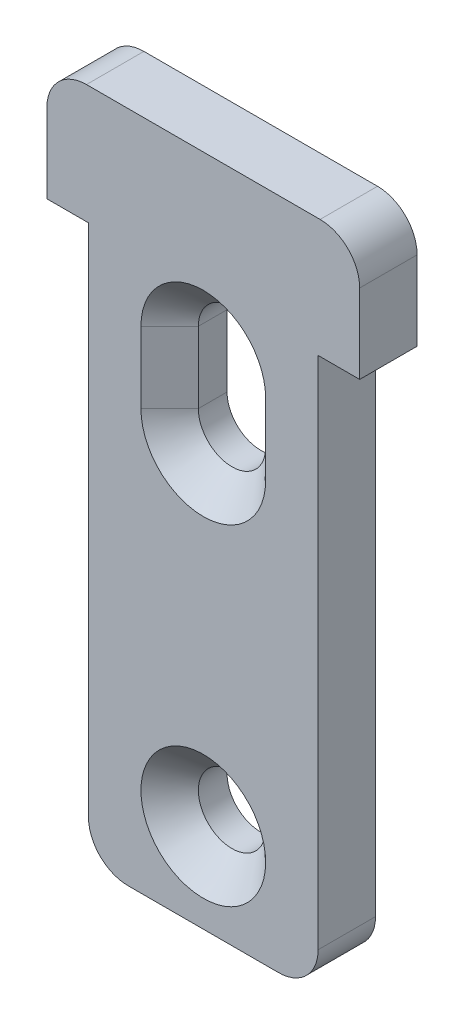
ISO-10303-21;
HEADER;
FILE_DESCRIPTION(('STEP AP214'),'2;1');
FILE_NAME('part.step','',(''),(''),'','','');
FILE_SCHEMA(('AUTOMOTIVE_DESIGN { 1 0 10303 214 1 1 1 1 }'));
ENDSEC;
DATA;
#1=APPLICATION_CONTEXT('core data for automotive mechanical design processes');
#2=APPLICATION_PROTOCOL_DEFINITION('international standard','automotive_design',2000,#1);
#3=PRODUCT_CONTEXT('',#1,'mechanical');
#4=PRODUCT('Part','Part','',(#3));
#5=PRODUCT_RELATED_PRODUCT_CATEGORY('part','',(#4));
#6=PRODUCT_DEFINITION_FORMATION('','',#4);
#7=PRODUCT_DEFINITION_CONTEXT('part definition',#1,'design');
#8=PRODUCT_DEFINITION('design','',#6,#7);
#9=PRODUCT_DEFINITION_SHAPE('','',#8);
#10=(LENGTH_UNIT() NAMED_UNIT(*) SI_UNIT(.MILLI.,.METRE.));
#11=(NAMED_UNIT(*) PLANE_ANGLE_UNIT() SI_UNIT($,.RADIAN.));
#12=(NAMED_UNIT(*) SI_UNIT($,.STERADIAN.) SOLID_ANGLE_UNIT());
#13=UNCERTAINTY_MEASURE_WITH_UNIT(LENGTH_MEASURE(1.E-05),#10,'distance_accuracy_value','');
#14=(GEOMETRIC_REPRESENTATION_CONTEXT(3) GLOBAL_UNCERTAINTY_ASSIGNED_CONTEXT((#13)) GLOBAL_UNIT_ASSIGNED_CONTEXT((#10,
#11,#12)) REPRESENTATION_CONTEXT('',''));
#15=CARTESIAN_POINT('',(0.,0.,0.));
#16=DIRECTION('',(0.,0.,1.));
#17=DIRECTION('',(1.,0.,0.));
#18=AXIS2_PLACEMENT_3D('',#15,#16,#17);
#19=CARTESIAN_POINT('',(5.9,4.,2.9));
#20=DIRECTION('',(0.,0.,-1.));
#21=DIRECTION('',(-1.,0.,0.));
#22=AXIS2_PLACEMENT_3D('',#19,#20,#21);
#23=PLANE('',#22);
#24=CARTESIAN_POINT('',(0.,-23.5,2.9));
#25=DIRECTION('',(0.,0.,1.));
#26=DIRECTION('',(1.,0.,0.));
#27=AXIS2_PLACEMENT_3D('',#24,#25,#26);
#28=CIRCLE('',#27,3.15);
#29=CARTESIAN_POINT('',(3.15,-23.5,2.9));
#30=VERTEX_POINT('',#29);
#31=EDGE_CURVE('E294',#30,#30,#28,.T.);
#32=ORIENTED_EDGE('',*,*,#31,.F.);
#33=EDGE_LOOP('',(#32));
#34=FACE_BOUND('',#33,.T.);
#35=DIRECTION('',(1.,0.,0.));
#36=VECTOR('',#35,1.);
#37=CARTESIAN_POINT('',(5.8,0.,2.9));
#38=LINE('',#37,#36);
#39=CARTESIAN_POINT('',(5.8,0.,2.9));
#40=VERTEX_POINT('',#39);
#41=CARTESIAN_POINT('',(7.9,0.,2.9));
#42=VERTEX_POINT('',#41);
#43=EDGE_CURVE('E303',#40,#42,#38,.T.);
#44=ORIENTED_EDGE('',*,*,#43,.T.);
#45=DIRECTION('',(0.,1.,0.));
#46=VECTOR('',#45,1.);
#47=CARTESIAN_POINT('',(7.9,0.,2.9));
#48=LINE('',#47,#46);
#49=CARTESIAN_POINT('',(7.9,3.99999999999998,2.9));
#50=VERTEX_POINT('',#49);
#51=EDGE_CURVE('E307',#42,#50,#48,.T.);
#52=ORIENTED_EDGE('',*,*,#51,.T.);
#53=CARTESIAN_POINT('',(5.9,4.,2.9));
#54=DIRECTION('',(0.,0.,1.));
#55=DIRECTION('',(-1.,0.,0.));
#56=AXIS2_PLACEMENT_3D('',#53,#54,#55);
#57=CIRCLE('',#56,2.);
#58=CARTESIAN_POINT('',(5.89999999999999,6.,2.9));
#59=VERTEX_POINT('',#58);
#60=EDGE_CURVE('E311',#50,#59,#57,.T.);
#61=ORIENTED_EDGE('',*,*,#60,.T.);
#62=DIRECTION('',(-1.,0.,0.));
#63=VECTOR('',#62,1.);
#64=CARTESIAN_POINT('',(-5.89999999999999,6.,2.9));
#65=LINE('',#64,#63);
#66=CARTESIAN_POINT('',(-5.89999999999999,6.,2.9));
#67=VERTEX_POINT('',#66);
#68=EDGE_CURVE('E314',#59,#67,#65,.T.);
#69=ORIENTED_EDGE('',*,*,#68,.T.);
#70=CARTESIAN_POINT('',(-5.9,4.,2.9));
#71=DIRECTION('',(0.,0.,1.));
#72=DIRECTION('',(-1.,0.,0.));
#73=AXIS2_PLACEMENT_3D('',#70,#71,#72);
#74=CIRCLE('',#73,2.);
#75=CARTESIAN_POINT('',(-7.9,3.99999999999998,2.9));
#76=VERTEX_POINT('',#75);
#77=EDGE_CURVE('E317',#67,#76,#74,.T.);
#78=ORIENTED_EDGE('',*,*,#77,.T.);
#79=DIRECTION('',(0.,-1.,0.));
#80=VECTOR('',#79,1.);
#81=CARTESIAN_POINT('',(-7.9,0.,2.9));
#82=LINE('',#81,#80);
#83=CARTESIAN_POINT('',(-7.9,0.,2.9));
#84=VERTEX_POINT('',#83);
#85=EDGE_CURVE('E320',#76,#84,#82,.T.);
#86=ORIENTED_EDGE('',*,*,#85,.T.);
#87=DIRECTION('',(1.,0.,0.));
#88=VECTOR('',#87,1.);
#89=CARTESIAN_POINT('',(-7.9,0.,2.9));
#90=LINE('',#89,#88);
#91=CARTESIAN_POINT('',(-5.8,0.,2.9));
#92=VERTEX_POINT('',#91);
#93=EDGE_CURVE('E323',#84,#92,#90,.T.);
#94=ORIENTED_EDGE('',*,*,#93,.T.);
#95=DIRECTION('',(0.,-1.,0.));
#96=VECTOR('',#95,1.);
#97=CARTESIAN_POINT('',(-5.8,0.,2.9));
#98=LINE('',#97,#96);
#99=CARTESIAN_POINT('',(-5.8,-26.,2.9));
#100=VERTEX_POINT('',#99);
#101=EDGE_CURVE('E326',#92,#100,#98,.T.);
#102=ORIENTED_EDGE('',*,*,#101,.T.);
#103=CARTESIAN_POINT('',(-3.8,-26.,2.9));
#104=DIRECTION('',(0.,0.,1.));
#105=DIRECTION('',(1.,0.,0.));
#106=AXIS2_PLACEMENT_3D('',#103,#104,#105);
#107=CIRCLE('',#106,2.);
#108=CARTESIAN_POINT('',(-3.79999999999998,-28.,2.9));
#109=VERTEX_POINT('',#108);
#110=EDGE_CURVE('E329',#100,#109,#107,.T.);
#111=ORIENTED_EDGE('',*,*,#110,.T.);
#112=DIRECTION('',(1.,0.,0.));
#113=VECTOR('',#112,1.);
#114=CARTESIAN_POINT('',(-3.79999999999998,-28.,2.9));
#115=LINE('',#114,#113);
#116=CARTESIAN_POINT('',(3.79999999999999,-28.,2.9));
#117=VERTEX_POINT('',#116);
#118=EDGE_CURVE('E332',#109,#117,#115,.T.);
#119=ORIENTED_EDGE('',*,*,#118,.T.);
#120=CARTESIAN_POINT('',(3.8,-26.,2.9));
#121=DIRECTION('',(0.,0.,1.));
#122=DIRECTION('',(1.,0.,0.));
#123=AXIS2_PLACEMENT_3D('',#120,#121,#122);
#124=CIRCLE('',#123,2.);
#125=CARTESIAN_POINT('',(5.8,-26.,2.9));
#126=VERTEX_POINT('',#125);
#127=EDGE_CURVE('E335',#117,#126,#124,.T.);
#128=ORIENTED_EDGE('',*,*,#127,.T.);
#129=DIRECTION('',(0.,1.,0.));
#130=VECTOR('',#129,1.);
#131=CARTESIAN_POINT('',(5.8,-26.,2.9));
#132=LINE('',#131,#130);
#133=EDGE_CURVE('E338',#126,#40,#132,.T.);
#134=ORIENTED_EDGE('',*,*,#133,.T.);
#135=EDGE_LOOP('',(#44,#52,#61,#69,#78,#86,#94,#102,#111,#119,#128,#134));
#136=FACE_BOUND('',#135,.T.);
#137=DIRECTION('',(0.,-1.,0.));
#138=VECTOR('',#137,1.);
#139=CARTESIAN_POINT('',(-3.14999999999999,-3.2,2.9));
#140=LINE('',#139,#138);
#141=CARTESIAN_POINT('',(-3.15,-3.2,2.9));
#142=VERTEX_POINT('',#141);
#143=CARTESIAN_POINT('',(-3.14999999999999,-6.8,2.9));
#144=VERTEX_POINT('',#143);
#145=EDGE_CURVE('E263',#142,#144,#140,.T.);
#146=ORIENTED_EDGE('',*,*,#145,.F.);
#147=CARTESIAN_POINT('',(0.,-3.2,2.9));
#148=DIRECTION('',(0.,0.,1.));
#149=DIRECTION('',(1.,0.,0.));
#150=AXIS2_PLACEMENT_3D('',#147,#148,#149);
#151=CIRCLE('',#150,3.15);
#152=CARTESIAN_POINT('',(3.15,-3.2,2.9));
#153=VERTEX_POINT('',#152);
#154=EDGE_CURVE('E256',#153,#142,#151,.T.);
#155=ORIENTED_EDGE('',*,*,#154,.F.);
#156=DIRECTION('',(0.,-1.,0.));
#157=VECTOR('',#156,1.);
#158=CARTESIAN_POINT('',(3.15,-3.2,2.9));
#159=LINE('',#158,#157);
#160=CARTESIAN_POINT('',(3.15,-6.8,2.9));
#161=VERTEX_POINT('',#160);
#162=EDGE_CURVE('E240',#153,#161,#159,.T.);
#163=ORIENTED_EDGE('',*,*,#162,.T.);
#164=CARTESIAN_POINT('',(0.,-6.8,2.9));
#165=DIRECTION('',(0.,0.,1.));
#166=DIRECTION('',(1.,0.,0.));
#167=AXIS2_PLACEMENT_3D('',#164,#165,#166);
#168=CIRCLE('',#167,3.15);
#169=EDGE_CURVE('E283',#144,#161,#168,.T.);
#170=ORIENTED_EDGE('',*,*,#169,.F.);
#171=EDGE_LOOP('',(#146,#155,#163,#170));
#172=FACE_BOUND('',#171,.T.);
#173=ADVANCED_FACE('F115',(#34,#136,#172),#23,.F.);
#174=CARTESIAN_POINT('',(5.9,4.,0.));
#175=DIRECTION('',(0.,0.,-1.));
#176=DIRECTION('',(-1.,0.,0.));
#177=AXIS2_PLACEMENT_3D('',#174,#175,#176);
#178=PLANE('',#177);
#179=CARTESIAN_POINT('',(0.,-23.5,0.));
#180=DIRECTION('',(0.,0.,-1.));
#181=DIRECTION('',(-1.,0.,0.));
#182=AXIS2_PLACEMENT_3D('',#179,#180,#181);
#183=CIRCLE('',#182,1.69999999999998);
#184=CARTESIAN_POINT('',(-1.69999999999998,-23.5,0.));
#185=VERTEX_POINT('',#184);
#186=EDGE_CURVE('E302',#185,#185,#183,.T.);
#187=ORIENTED_EDGE('',*,*,#186,.F.);
#188=EDGE_LOOP('',(#187));
#189=FACE_BOUND('',#188,.T.);
#190=DIRECTION('',(1.,0.,0.));
#191=VECTOR('',#190,1.);
#192=CARTESIAN_POINT('',(5.8,0.,0.));
#193=LINE('',#192,#191);
#194=CARTESIAN_POINT('',(5.8,0.,0.));
#195=VERTEX_POINT('',#194);
#196=CARTESIAN_POINT('',(7.9,0.,0.));
#197=VERTEX_POINT('',#196);
#198=EDGE_CURVE('E342',#195,#197,#193,.T.);
#199=ORIENTED_EDGE('',*,*,#198,.F.);
#200=DIRECTION('',(0.,1.,0.));
#201=VECTOR('',#200,1.);
#202=CARTESIAN_POINT('',(5.8,-26.,0.));
#203=LINE('',#202,#201);
#204=CARTESIAN_POINT('',(5.8,-26.,0.));
#205=VERTEX_POINT('',#204);
#206=EDGE_CURVE('E308',#205,#195,#203,.T.);
#207=ORIENTED_EDGE('',*,*,#206,.F.);
#208=CARTESIAN_POINT('',(3.8,-26.,0.));
#209=DIRECTION('',(0.,0.,1.));
#210=DIRECTION('',(1.,0.,0.));
#211=AXIS2_PLACEMENT_3D('',#208,#209,#210);
#212=CIRCLE('',#211,2.);
#213=CARTESIAN_POINT('',(3.79999999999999,-28.,0.));
#214=VERTEX_POINT('',#213);
#215=EDGE_CURVE('E373',#214,#205,#212,.T.);
#216=ORIENTED_EDGE('',*,*,#215,.F.);
#217=DIRECTION('',(1.,0.,0.));
#218=VECTOR('',#217,1.);
#219=CARTESIAN_POINT('',(-3.79999999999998,-28.,0.));
#220=LINE('',#219,#218);
#221=CARTESIAN_POINT('',(-3.79999999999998,-28.,0.));
#222=VERTEX_POINT('',#221);
#223=EDGE_CURVE('E370',#222,#214,#220,.T.);
#224=ORIENTED_EDGE('',*,*,#223,.F.);
#225=CARTESIAN_POINT('',(-3.8,-26.,0.));
#226=DIRECTION('',(0.,0.,1.));
#227=DIRECTION('',(1.,0.,0.));
#228=AXIS2_PLACEMENT_3D('',#225,#226,#227);
#229=CIRCLE('',#228,2.);
#230=CARTESIAN_POINT('',(-5.8,-26.,0.));
#231=VERTEX_POINT('',#230);
#232=EDGE_CURVE('E367',#231,#222,#229,.T.);
#233=ORIENTED_EDGE('',*,*,#232,.F.);
#234=DIRECTION('',(0.,-1.,0.));
#235=VECTOR('',#234,1.);
#236=CARTESIAN_POINT('',(-5.8,0.,0.));
#237=LINE('',#236,#235);
#238=CARTESIAN_POINT('',(-5.8,0.,0.));
#239=VERTEX_POINT('',#238);
#240=EDGE_CURVE('E364',#239,#231,#237,.T.);
#241=ORIENTED_EDGE('',*,*,#240,.F.);
#242=DIRECTION('',(1.,0.,0.));
#243=VECTOR('',#242,1.);
#244=CARTESIAN_POINT('',(-7.9,0.,0.));
#245=LINE('',#244,#243);
#246=CARTESIAN_POINT('',(-7.9,0.,0.));
#247=VERTEX_POINT('',#246);
#248=EDGE_CURVE('E361',#247,#239,#245,.T.);
#249=ORIENTED_EDGE('',*,*,#248,.F.);
#250=DIRECTION('',(0.,-1.,0.));
#251=VECTOR('',#250,1.);
#252=CARTESIAN_POINT('',(-7.9,0.,0.));
#253=LINE('',#252,#251);
#254=CARTESIAN_POINT('',(-7.9,3.99999999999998,0.));
#255=VERTEX_POINT('',#254);
#256=EDGE_CURVE('E358',#255,#247,#253,.T.);
#257=ORIENTED_EDGE('',*,*,#256,.F.);
#258=CARTESIAN_POINT('',(-5.9,4.,0.));
#259=DIRECTION('',(0.,0.,1.));
#260=DIRECTION('',(-1.,0.,0.));
#261=AXIS2_PLACEMENT_3D('',#258,#259,#260);
#262=CIRCLE('',#261,2.);
#263=CARTESIAN_POINT('',(-5.89999999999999,6.,0.));
#264=VERTEX_POINT('',#263);
#265=EDGE_CURVE('E355',#264,#255,#262,.T.);
#266=ORIENTED_EDGE('',*,*,#265,.F.);
#267=DIRECTION('',(-1.,0.,0.));
#268=VECTOR('',#267,1.);
#269=CARTESIAN_POINT('',(-5.89999999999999,6.,0.));
#270=LINE('',#269,#268);
#271=CARTESIAN_POINT('',(5.89999999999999,6.,0.));
#272=VERTEX_POINT('',#271);
#273=EDGE_CURVE('E352',#272,#264,#270,.T.);
#274=ORIENTED_EDGE('',*,*,#273,.F.);
#275=CARTESIAN_POINT('',(5.9,4.,0.));
#276=DIRECTION('',(0.,0.,1.));
#277=DIRECTION('',(-1.,0.,0.));
#278=AXIS2_PLACEMENT_3D('',#275,#276,#277);
#279=CIRCLE('',#278,2.);
#280=CARTESIAN_POINT('',(7.9,3.99999999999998,0.));
#281=VERTEX_POINT('',#280);
#282=EDGE_CURVE('E349',#281,#272,#279,.T.);
#283=ORIENTED_EDGE('',*,*,#282,.F.);
#284=DIRECTION('',(0.,1.,0.));
#285=VECTOR('',#284,1.);
#286=CARTESIAN_POINT('',(7.9,0.,0.));
#287=LINE('',#286,#285);
#288=EDGE_CURVE('E346',#197,#281,#287,.T.);
#289=ORIENTED_EDGE('',*,*,#288,.F.);
#290=EDGE_LOOP('',(#199,#207,#216,#224,#233,#241,#249,#257,#266,#274,#283,#289));
#291=FACE_BOUND('',#290,.T.);
#292=CARTESIAN_POINT('',(0.,-6.8,0.));
#293=DIRECTION('',(0.,0.,-1.));
#294=DIRECTION('',(-1.,0.,0.));
#295=AXIS2_PLACEMENT_3D('',#292,#293,#294);
#296=CIRCLE('',#295,1.69999999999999);
#297=CARTESIAN_POINT('',(1.69999999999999,-6.8,0.));
#298=VERTEX_POINT('',#297);
#299=CARTESIAN_POINT('',(-1.69999999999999,-6.8,0.));
#300=VERTEX_POINT('',#299);
#301=EDGE_CURVE('E431',#298,#300,#296,.T.);
#302=ORIENTED_EDGE('',*,*,#301,.F.);
#303=DIRECTION('',(0.,1.,0.));
#304=VECTOR('',#303,1.);
#305=CARTESIAN_POINT('',(1.69999999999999,4.,0.));
#306=LINE('',#305,#304);
#307=CARTESIAN_POINT('',(1.69999999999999,-3.2,0.));
#308=VERTEX_POINT('',#307);
#309=EDGE_CURVE('E13',#298,#308,#306,.T.);
#310=ORIENTED_EDGE('',*,*,#309,.T.);
#311=CARTESIAN_POINT('',(0.,-3.2,0.));
#312=DIRECTION('',(0.,0.,-1.));
#313=DIRECTION('',(-1.,0.,0.));
#314=AXIS2_PLACEMENT_3D('',#311,#312,#313);
#315=CIRCLE('',#314,1.69999999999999);
#316=CARTESIAN_POINT('',(-1.69999999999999,-3.2,0.));
#317=VERTEX_POINT('',#316);
#318=EDGE_CURVE('E124',#317,#308,#315,.T.);
#319=ORIENTED_EDGE('',*,*,#318,.F.);
#320=DIRECTION('',(0.,1.,0.));
#321=VECTOR('',#320,1.);
#322=CARTESIAN_POINT('',(-1.69999999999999,4.,0.));
#323=LINE('',#322,#321);
#324=EDGE_CURVE('E425',#300,#317,#323,.T.);
#325=ORIENTED_EDGE('',*,*,#324,.F.);
#326=EDGE_LOOP('',(#302,#310,#319,#325));
#327=FACE_BOUND('',#326,.T.);
#328=ADVANCED_FACE('F445',(#189,#291,#327),#178,.T.);
#329=CARTESIAN_POINT('',(5.8,0.,2.9));
#330=DIRECTION('',(0.,1.,0.));
#331=DIRECTION('',(-1.,0.,0.));
#332=AXIS2_PLACEMENT_3D('',#329,#330,#331);
#333=PLANE('',#332);
#334=ORIENTED_EDGE('',*,*,#198,.T.);
#335=DIRECTION('',(0.,0.,-1.));
#336=VECTOR('',#335,1.);
#337=CARTESIAN_POINT('',(7.9,0.,2.9));
#338=LINE('',#337,#336);
#339=EDGE_CURVE('E421',#42,#197,#338,.T.);
#340=ORIENTED_EDGE('',*,*,#339,.F.);
#341=ORIENTED_EDGE('',*,*,#43,.F.);
#342=DIRECTION('',(0.,0.,-1.));
#343=VECTOR('',#342,1.);
#344=CARTESIAN_POINT('',(5.8,0.,2.9));
#345=LINE('',#344,#343);
#346=EDGE_CURVE('E341',#40,#195,#345,.T.);
#347=ORIENTED_EDGE('',*,*,#346,.T.);
#348=EDGE_LOOP('',(#334,#340,#341,#347));
#349=FACE_BOUND('',#348,.T.);
#350=ADVANCED_FACE('F117',(#349),#333,.F.);
#351=CARTESIAN_POINT('',(7.9,0.,2.9));
#352=DIRECTION('',(-1.,0.,0.));
#353=DIRECTION('',(0.,0.,1.));
#354=AXIS2_PLACEMENT_3D('',#351,#352,#353);
#355=PLANE('',#354);
#356=ORIENTED_EDGE('',*,*,#288,.T.);
#357=DIRECTION('',(0.,0.,-1.));
#358=VECTOR('',#357,1.);
#359=CARTESIAN_POINT('',(7.9,3.99999999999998,2.9));
#360=LINE('',#359,#358);
#361=EDGE_CURVE('E417',#50,#281,#360,.T.);
#362=ORIENTED_EDGE('',*,*,#361,.F.);
#363=ORIENTED_EDGE('',*,*,#51,.F.);
#364=ORIENTED_EDGE('',*,*,#339,.T.);
#365=EDGE_LOOP('',(#356,#362,#363,#364));
#366=FACE_BOUND('',#365,.T.);
#367=ADVANCED_FACE('F523',(#366),#355,.F.);
#368=CARTESIAN_POINT('',(5.9,4.,2.9));
#369=DIRECTION('',(0.,0.,-1.));
#370=DIRECTION('',(-1.,0.,0.));
#371=AXIS2_PLACEMENT_3D('',#368,#369,#370);
#372=CYLINDRICAL_SURFACE('',#371,2.);
#373=ORIENTED_EDGE('',*,*,#282,.T.);
#374=DIRECTION('',(0.,0.,-1.));
#375=VECTOR('',#374,1.);
#376=CARTESIAN_POINT('',(5.89999999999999,6.,2.9));
#377=LINE('',#376,#375);
#378=EDGE_CURVE('E413',#59,#272,#377,.T.);
#379=ORIENTED_EDGE('',*,*,#378,.F.);
#380=ORIENTED_EDGE('',*,*,#60,.F.);
#381=ORIENTED_EDGE('',*,*,#361,.T.);
#382=EDGE_LOOP('',(#373,#379,#380,#381));
#383=FACE_BOUND('',#382,.T.);
#384=ADVANCED_FACE('F520',(#383),#372,.T.);
#385=CARTESIAN_POINT('',(-5.89999999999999,6.,2.9));
#386=DIRECTION('',(0.,-1.,0.));
#387=DIRECTION('',(0.,0.,-1.));
#388=AXIS2_PLACEMENT_3D('',#385,#386,#387);
#389=PLANE('',#388);
#390=ORIENTED_EDGE('',*,*,#273,.T.);
#391=DIRECTION('',(0.,0.,-1.));
#392=VECTOR('',#391,1.);
#393=CARTESIAN_POINT('',(-5.89999999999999,6.,2.9));
#394=LINE('',#393,#392);
#395=EDGE_CURVE('E409',#67,#264,#394,.T.);
#396=ORIENTED_EDGE('',*,*,#395,.F.);
#397=ORIENTED_EDGE('',*,*,#68,.F.);
#398=ORIENTED_EDGE('',*,*,#378,.T.);
#399=EDGE_LOOP('',(#390,#396,#397,#398));
#400=FACE_BOUND('',#399,.T.);
#401=ADVANCED_FACE('F516',(#400),#389,.F.);
#402=CARTESIAN_POINT('',(-5.9,4.,2.9));
#403=DIRECTION('',(0.,0.,-1.));
#404=DIRECTION('',(-1.,0.,0.));
#405=AXIS2_PLACEMENT_3D('',#402,#403,#404);
#406=CYLINDRICAL_SURFACE('',#405,2.);
#407=ORIENTED_EDGE('',*,*,#265,.T.);
#408=DIRECTION('',(0.,0.,-1.));
#409=VECTOR('',#408,1.);
#410=CARTESIAN_POINT('',(-7.9,3.99999999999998,2.9));
#411=LINE('',#410,#409);
#412=EDGE_CURVE('E405',#76,#255,#411,.T.);
#413=ORIENTED_EDGE('',*,*,#412,.F.);
#414=ORIENTED_EDGE('',*,*,#77,.F.);
#415=ORIENTED_EDGE('',*,*,#395,.T.);
#416=EDGE_LOOP('',(#407,#413,#414,#415));
#417=FACE_BOUND('',#416,.T.);
#418=ADVANCED_FACE('F512',(#417),#406,.T.);
#419=CARTESIAN_POINT('',(-7.9,0.,2.9));
#420=DIRECTION('',(1.,0.,0.));
#421=DIRECTION('',(0.,0.,-1.));
#422=AXIS2_PLACEMENT_3D('',#419,#420,#421);
#423=PLANE('',#422);
#424=ORIENTED_EDGE('',*,*,#256,.T.);
#425=DIRECTION('',(0.,0.,-1.));
#426=VECTOR('',#425,1.);
#427=CARTESIAN_POINT('',(-7.9,0.,2.9));
#428=LINE('',#427,#426);
#429=EDGE_CURVE('E401',#84,#247,#428,.T.);
#430=ORIENTED_EDGE('',*,*,#429,.F.);
#431=ORIENTED_EDGE('',*,*,#85,.F.);
#432=ORIENTED_EDGE('',*,*,#412,.T.);
#433=EDGE_LOOP('',(#424,#430,#431,#432));
#434=FACE_BOUND('',#433,.T.);
#435=ADVANCED_FACE('F508',(#434),#423,.F.);
#436=CARTESIAN_POINT('',(-7.9,0.,2.9));
#437=DIRECTION('',(0.,1.,0.));
#438=DIRECTION('',(-1.,0.,0.));
#439=AXIS2_PLACEMENT_3D('',#436,#437,#438);
#440=PLANE('',#439);
#441=ORIENTED_EDGE('',*,*,#248,.T.);
#442=DIRECTION('',(0.,0.,-1.));
#443=VECTOR('',#442,1.);
#444=CARTESIAN_POINT('',(-5.8,0.,2.9));
#445=LINE('',#444,#443);
#446=EDGE_CURVE('E397',#92,#239,#445,.T.);
#447=ORIENTED_EDGE('',*,*,#446,.F.);
#448=ORIENTED_EDGE('',*,*,#93,.F.);
#449=ORIENTED_EDGE('',*,*,#429,.T.);
#450=EDGE_LOOP('',(#441,#447,#448,#449));
#451=FACE_BOUND('',#450,.T.);
#452=ADVANCED_FACE('F504',(#451),#440,.F.);
#453=CARTESIAN_POINT('',(-5.8,0.,2.9));
#454=DIRECTION('',(1.,0.,0.));
#455=DIRECTION('',(0.,1.,0.));
#456=AXIS2_PLACEMENT_3D('',#453,#454,#455);
#457=PLANE('',#456);
#458=ORIENTED_EDGE('',*,*,#240,.T.);
#459=DIRECTION('',(0.,0.,-1.));
#460=VECTOR('',#459,1.);
#461=CARTESIAN_POINT('',(-5.8,-26.,2.9));
#462=LINE('',#461,#460);
#463=EDGE_CURVE('E393',#100,#231,#462,.T.);
#464=ORIENTED_EDGE('',*,*,#463,.F.);
#465=ORIENTED_EDGE('',*,*,#101,.F.);
#466=ORIENTED_EDGE('',*,*,#446,.T.);
#467=EDGE_LOOP('',(#458,#464,#465,#466));
#468=FACE_BOUND('',#467,.T.);
#469=ADVANCED_FACE('F500',(#468),#457,.F.);
#470=CARTESIAN_POINT('',(-3.8,-26.,2.9));
#471=DIRECTION('',(0.,0.,-1.));
#472=DIRECTION('',(-1.,0.,0.));
#473=AXIS2_PLACEMENT_3D('',#470,#471,#472);
#474=CYLINDRICAL_SURFACE('',#473,2.);
#475=ORIENTED_EDGE('',*,*,#232,.T.);
#476=DIRECTION('',(0.,0.,-1.));
#477=VECTOR('',#476,1.);
#478=CARTESIAN_POINT('',(-3.79999999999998,-28.,2.9));
#479=LINE('',#478,#477);
#480=EDGE_CURVE('E389',#109,#222,#479,.T.);
#481=ORIENTED_EDGE('',*,*,#480,.F.);
#482=ORIENTED_EDGE('',*,*,#110,.F.);
#483=ORIENTED_EDGE('',*,*,#463,.T.);
#484=EDGE_LOOP('',(#475,#481,#482,#483));
#485=FACE_BOUND('',#484,.T.);
#486=ADVANCED_FACE('F496',(#485),#474,.T.);
#487=CARTESIAN_POINT('',(-3.79999999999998,-28.,2.9));
#488=DIRECTION('',(0.,1.,0.));
#489=DIRECTION('',(0.,0.,1.));
#490=AXIS2_PLACEMENT_3D('',#487,#488,#489);
#491=PLANE('',#490);
#492=ORIENTED_EDGE('',*,*,#223,.T.);
#493=DIRECTION('',(0.,0.,-1.));
#494=VECTOR('',#493,1.);
#495=CARTESIAN_POINT('',(3.79999999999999,-28.,2.9));
#496=LINE('',#495,#494);
#497=EDGE_CURVE('E385',#117,#214,#496,.T.);
#498=ORIENTED_EDGE('',*,*,#497,.F.);
#499=ORIENTED_EDGE('',*,*,#118,.F.);
#500=ORIENTED_EDGE('',*,*,#480,.T.);
#501=EDGE_LOOP('',(#492,#498,#499,#500));
#502=FACE_BOUND('',#501,.T.);
#503=ADVANCED_FACE('F492',(#502),#491,.F.);
#504=CARTESIAN_POINT('',(3.8,-26.,2.9));
#505=DIRECTION('',(0.,0.,-1.));
#506=DIRECTION('',(-1.,0.,0.));
#507=AXIS2_PLACEMENT_3D('',#504,#505,#506);
#508=CYLINDRICAL_SURFACE('',#507,2.);
#509=ORIENTED_EDGE('',*,*,#215,.T.);
#510=DIRECTION('',(0.,0.,-1.));
#511=VECTOR('',#510,1.);
#512=CARTESIAN_POINT('',(5.8,-26.,2.9));
#513=LINE('',#512,#511);
#514=EDGE_CURVE('E381',#126,#205,#513,.T.);
#515=ORIENTED_EDGE('',*,*,#514,.F.);
#516=ORIENTED_EDGE('',*,*,#127,.F.);
#517=ORIENTED_EDGE('',*,*,#497,.T.);
#518=EDGE_LOOP('',(#509,#515,#516,#517));
#519=FACE_BOUND('',#518,.T.);
#520=ADVANCED_FACE('F488',(#519),#508,.T.);
#521=CARTESIAN_POINT('',(5.8,-26.,2.9));
#522=DIRECTION('',(-1.,0.,0.));
#523=DIRECTION('',(0.,0.,1.));
#524=AXIS2_PLACEMENT_3D('',#521,#522,#523);
#525=PLANE('',#524);
#526=ORIENTED_EDGE('',*,*,#206,.T.);
#527=ORIENTED_EDGE('',*,*,#346,.F.);
#528=ORIENTED_EDGE('',*,*,#133,.F.);
#529=ORIENTED_EDGE('',*,*,#514,.T.);
#530=EDGE_LOOP('',(#526,#527,#528,#529));
#531=FACE_BOUND('',#530,.T.);
#532=ADVANCED_FACE('F485',(#531),#525,.F.);
#533=CARTESIAN_POINT('',(0.,-23.5,2.9));
#534=DIRECTION('',(0.,0.,1.));
#535=DIRECTION('',(1.,0.,0.));
#536=AXIS2_PLACEMENT_3D('',#533,#534,#535);
#537=CYLINDRICAL_SURFACE('',#536,1.69999999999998);
#538=ORIENTED_EDGE('',*,*,#186,.T.);
#539=EDGE_LOOP('',(#538));
#540=FACE_BOUND('',#539,.T.);
#541=CARTESIAN_POINT('',(0.,-23.5,1.44999999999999));
#542=DIRECTION('',(0.,0.,1.));
#543=DIRECTION('',(1.,0.,0.));
#544=AXIS2_PLACEMENT_3D('',#541,#542,#543);
#545=CIRCLE('',#544,1.69999999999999);
#546=CARTESIAN_POINT('',(1.69999999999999,-23.5,1.44999999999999));
#547=VERTEX_POINT('',#546);
#548=EDGE_CURVE('E298',#547,#547,#545,.T.);
#549=ORIENTED_EDGE('',*,*,#548,.T.);
#550=EDGE_LOOP('',(#549));
#551=FACE_BOUND('',#550,.T.);
#552=ADVANCED_FACE('F482',(#540,#551),#537,.F.);
#553=CARTESIAN_POINT('',(0.,-23.5,2.9));
#554=DIRECTION('',(0.,0.,1.));
#555=DIRECTION('',(1.,0.,0.));
#556=AXIS2_PLACEMENT_3D('',#553,#554,#555);
#557=CONICAL_SURFACE('',#556,3.15,0.78539816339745);
#558=ORIENTED_EDGE('',*,*,#548,.F.);
#559=EDGE_LOOP('',(#558));
#560=FACE_BOUND('',#559,.T.);
#561=ORIENTED_EDGE('',*,*,#31,.T.);
#562=EDGE_LOOP('',(#561));
#563=FACE_BOUND('',#562,.T.);
#564=ADVANCED_FACE('F592',(#560,#563),#557,.F.);
#565=CARTESIAN_POINT('',(0.,-6.8,2.9));
#566=DIRECTION('',(0.,0.,1.));
#567=DIRECTION('',(1.,0.,0.));
#568=AXIS2_PLACEMENT_3D('',#565,#566,#567);
#569=CYLINDRICAL_SURFACE('',#568,1.69999999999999);
#570=ORIENTED_EDGE('',*,*,#301,.T.);
#571=DIRECTION('',(0.,0.,1.));
#572=VECTOR('',#571,1.);
#573=CARTESIAN_POINT('',(-1.69999999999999,-6.8,2.9));
#574=LINE('',#573,#572);
#575=CARTESIAN_POINT('',(-1.69999999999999,-6.8,1.44999999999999));
#576=VERTEX_POINT('',#575);
#577=EDGE_CURVE('E139',#576,#300,#574,.F.);
#578=ORIENTED_EDGE('',*,*,#577,.F.);
#579=CARTESIAN_POINT('',(0.,-6.8,1.44999999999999));
#580=DIRECTION('',(0.,0.,1.));
#581=DIRECTION('',(1.,0.,0.));
#582=AXIS2_PLACEMENT_3D('',#579,#580,#581);
#583=CIRCLE('',#582,1.69999999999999);
#584=CARTESIAN_POINT('',(1.69999999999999,-6.8,1.44999999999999));
#585=VERTEX_POINT('',#584);
#586=EDGE_CURVE('E286',#576,#585,#583,.T.);
#587=ORIENTED_EDGE('',*,*,#586,.T.);
#588=DIRECTION('',(0.,0.,-1.));
#589=VECTOR('',#588,1.);
#590=CARTESIAN_POINT('',(1.7,-6.8,-2.1));
#591=LINE('',#590,#589);
#592=EDGE_CURVE('E279',#585,#298,#591,.T.);
#593=ORIENTED_EDGE('',*,*,#592,.T.);
#594=EDGE_LOOP('',(#570,#578,#587,#593));
#595=FACE_BOUND('',#594,.T.);
#596=ADVANCED_FACE('F447',(#595),#569,.F.);
#597=CARTESIAN_POINT('',(0.,-6.8,2.9));
#598=DIRECTION('',(0.,0.,1.));
#599=DIRECTION('',(1.,0.,0.));
#600=AXIS2_PLACEMENT_3D('',#597,#598,#599);
#601=CONICAL_SURFACE('',#600,3.15,0.78539816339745);
#602=ORIENTED_EDGE('',*,*,#169,.T.);
#603=DIRECTION('',(-0.707106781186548,0.,-0.707106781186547));
#604=VECTOR('',#603,1.);
#605=CARTESIAN_POINT('',(1.69999999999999,-6.8,1.44999999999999));
#606=LINE('',#605,#604);
#607=EDGE_CURVE('E131',#161,#585,#606,.T.);
#608=ORIENTED_EDGE('',*,*,#607,.T.);
#609=ORIENTED_EDGE('',*,*,#586,.F.);
#610=DIRECTION('',(-0.707106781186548,0.,0.707106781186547));
#611=VECTOR('',#610,1.);
#612=CARTESIAN_POINT('',(0.,-6.8,-0.249999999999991));
#613=LINE('',#612,#611);
#614=EDGE_CURVE('E290',#144,#576,#613,.F.);
#615=ORIENTED_EDGE('',*,*,#614,.F.);
#616=EDGE_LOOP('',(#602,#608,#609,#615));
#617=FACE_BOUND('',#616,.T.);
#618=ADVANCED_FACE('F451',(#617),#601,.F.);
#619=CARTESIAN_POINT('',(0.,-3.2,2.9));
#620=DIRECTION('',(0.,0.,1.));
#621=DIRECTION('',(1.,0.,0.));
#622=AXIS2_PLACEMENT_3D('',#619,#620,#621);
#623=CYLINDRICAL_SURFACE('',#622,1.69999999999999);
#624=ORIENTED_EDGE('',*,*,#318,.T.);
#625=DIRECTION('',(0.,0.,-1.));
#626=VECTOR('',#625,1.);
#627=CARTESIAN_POINT('',(1.7,-3.2,-2.1));
#628=LINE('',#627,#626);
#629=CARTESIAN_POINT('',(1.69999999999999,-3.2,1.44999999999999));
#630=VERTEX_POINT('',#629);
#631=EDGE_CURVE('E261',#630,#308,#628,.T.);
#632=ORIENTED_EDGE('',*,*,#631,.F.);
#633=CARTESIAN_POINT('',(0.,-3.2,1.44999999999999));
#634=DIRECTION('',(0.,0.,1.));
#635=DIRECTION('',(1.,0.,0.));
#636=AXIS2_PLACEMENT_3D('',#633,#634,#635);
#637=CIRCLE('',#636,1.69999999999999);
#638=CARTESIAN_POINT('',(-1.69999999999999,-3.2,1.44999999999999));
#639=VERTEX_POINT('',#638);
#640=EDGE_CURVE('E259',#630,#639,#637,.T.);
#641=ORIENTED_EDGE('',*,*,#640,.T.);
#642=DIRECTION('',(0.,0.,1.));
#643=VECTOR('',#642,1.);
#644=CARTESIAN_POINT('',(-1.69999999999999,-3.2,2.9));
#645=LINE('',#644,#643);
#646=EDGE_CURVE('E248',#317,#639,#645,.T.);
#647=ORIENTED_EDGE('',*,*,#646,.F.);
#648=EDGE_LOOP('',(#624,#632,#641,#647));
#649=FACE_BOUND('',#648,.T.);
#650=ADVANCED_FACE('F438',(#649),#623,.F.);
#651=CARTESIAN_POINT('',(0.,-3.2,2.9));
#652=DIRECTION('',(0.,0.,1.));
#653=DIRECTION('',(1.,0.,0.));
#654=AXIS2_PLACEMENT_3D('',#651,#652,#653);
#655=CONICAL_SURFACE('',#654,3.15,0.78539816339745);
#656=ORIENTED_EDGE('',*,*,#640,.F.);
#657=DIRECTION('',(-0.707106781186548,0.,-0.707106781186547));
#658=VECTOR('',#657,1.);
#659=CARTESIAN_POINT('',(1.69999999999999,-3.2,1.44999999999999));
#660=LINE('',#659,#658);
#661=EDGE_CURVE('E243',#153,#630,#660,.T.);
#662=ORIENTED_EDGE('',*,*,#661,.F.);
#663=ORIENTED_EDGE('',*,*,#154,.T.);
#664=DIRECTION('',(0.707106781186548,0.,-0.707106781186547));
#665=VECTOR('',#664,1.);
#666=CARTESIAN_POINT('',(0.,-3.2,-0.249999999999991));
#667=LINE('',#666,#665);
#668=EDGE_CURVE('E268',#639,#142,#667,.F.);
#669=ORIENTED_EDGE('',*,*,#668,.F.);
#670=EDGE_LOOP('',(#656,#662,#663,#669));
#671=FACE_BOUND('',#670,.T.);
#672=ADVANCED_FACE('F254',(#671),#655,.F.);
#673=CARTESIAN_POINT('',(1.69999999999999,-3.2,1.44999999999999));
#674=DIRECTION('',(-0.707106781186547,0.,0.707106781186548));
#675=DIRECTION('',(0.707106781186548,0.,0.707106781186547));
#676=AXIS2_PLACEMENT_3D('',#673,#674,#675);
#677=PLANE('',#676);
#678=ORIENTED_EDGE('',*,*,#607,.F.);
#679=ORIENTED_EDGE('',*,*,#162,.F.);
#680=ORIENTED_EDGE('',*,*,#661,.T.);
#681=DIRECTION('',(0.,-1.,0.));
#682=VECTOR('',#681,1.);
#683=CARTESIAN_POINT('',(1.69999999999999,-3.2,1.44999999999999));
#684=LINE('',#683,#682);
#685=EDGE_CURVE('E249',#630,#585,#684,.T.);
#686=ORIENTED_EDGE('',*,*,#685,.T.);
#687=EDGE_LOOP('',(#678,#679,#680,#686));
#688=FACE_BOUND('',#687,.T.);
#689=ADVANCED_FACE('F242',(#688),#677,.T.);
#690=CARTESIAN_POINT('',(1.7,-3.2,-2.1));
#691=DIRECTION('',(-1.,0.,0.));
#692=DIRECTION('',(0.,0.,1.));
#693=AXIS2_PLACEMENT_3D('',#690,#691,#692);
#694=PLANE('',#693);
#695=ORIENTED_EDGE('',*,*,#592,.F.);
#696=ORIENTED_EDGE('',*,*,#685,.F.);
#697=ORIENTED_EDGE('',*,*,#631,.T.);
#698=ORIENTED_EDGE('',*,*,#309,.F.);
#699=EDGE_LOOP('',(#695,#696,#697,#698));
#700=FACE_BOUND('',#699,.T.);
#701=ADVANCED_FACE('F443',(#700),#694,.T.);
#702=CARTESIAN_POINT('',(-1.69999999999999,-3.2,2.9));
#703=DIRECTION('',(-1.,0.,0.));
#704=DIRECTION('',(0.,-1.,0.));
#705=AXIS2_PLACEMENT_3D('',#702,#703,#704);
#706=PLANE('',#705);
#707=ORIENTED_EDGE('',*,*,#324,.T.);
#708=ORIENTED_EDGE('',*,*,#646,.T.);
#709=DIRECTION('',(0.,-1.,0.));
#710=VECTOR('',#709,1.);
#711=CARTESIAN_POINT('',(-1.69999999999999,-3.2,1.44999999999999));
#712=LINE('',#711,#710);
#713=EDGE_CURVE('E453',#639,#576,#712,.T.);
#714=ORIENTED_EDGE('',*,*,#713,.T.);
#715=ORIENTED_EDGE('',*,*,#577,.T.);
#716=EDGE_LOOP('',(#707,#708,#714,#715));
#717=FACE_BOUND('',#716,.T.);
#718=ADVANCED_FACE('F461',(#717),#706,.F.);
#719=CARTESIAN_POINT('',(0.,-3.2,-0.249999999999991));
#720=DIRECTION('',(-0.707106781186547,0.,-0.707106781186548));
#721=DIRECTION('',(-0.707106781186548,0.,0.707106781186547));
#722=AXIS2_PLACEMENT_3D('',#719,#720,#721);
#723=PLANE('',#722);
#724=ORIENTED_EDGE('',*,*,#614,.T.);
#725=ORIENTED_EDGE('',*,*,#713,.F.);
#726=ORIENTED_EDGE('',*,*,#668,.T.);
#727=ORIENTED_EDGE('',*,*,#145,.T.);
#728=EDGE_LOOP('',(#724,#725,#726,#727));
#729=FACE_BOUND('',#728,.T.);
#730=ADVANCED_FACE('F463',(#729),#723,.F.);
#731=CLOSED_SHELL('',(#173,#328,#350,#367,#384,#401,#418,#435,#452,#469,#486,#503,#520,#532,
#552,#564,#596,#618,#650,#672,#689,#701,#718,#730));
#732=MANIFOLD_SOLID_BREP('B2',#731);
#733=ADVANCED_BREP_SHAPE_REPRESENTATION('',(#18,#732),#14);
#734=SHAPE_DEFINITION_REPRESENTATION(#9,#733);
ENDSEC;
END-ISO-10303-21;
